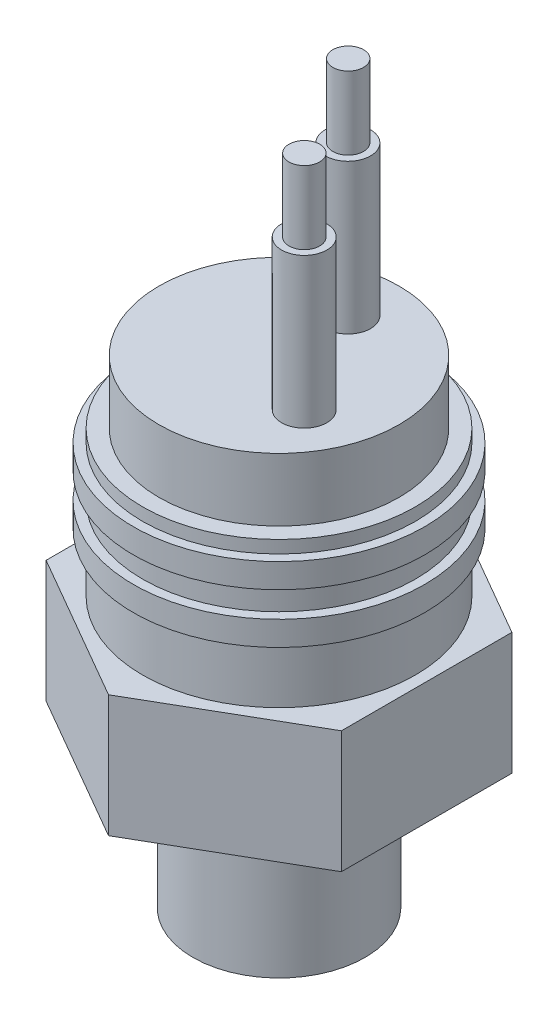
from build123d import *

# Parameters (mm, degrees)
EXTRUDE1_DEPTH    = 7.874
SKETCH3_R         = 7.747
EXTRUDE2_DEPTH    = 4.064
SKETCH4_R         = 1.4605
EXTRUDE3_DEPTH    = 9.652
SKETCH5_R         = 0.9906
EXTRUDE4_DEPTH    = 4.699
CIRPATTERN1_COUNT = 2
CIRPATTERN1_ANGLE = 120
SKETCH8_R         = 5.55625
EXTRUDE7_DEPTH    = 9.525
SKETCH9_R         = 0.89


with BuildPart() as part:
    # Sketch1 → Extrude1 (new body)
    with BuildSketch(Plane(origin=(0, 0, 0), x_dir=(1, 0, 0), z_dir=(0, 1, 0))):
        Polygon((0, 10.998522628), (-9.525, 5.499261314), (-9.525, -5.499261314), (0, -10.998522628), (9.525, -5.499261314), (9.525, 5.499261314), align=None)
    extrude(amount=EXTRUDE1_DEPTH)

    # Sketch2 → Revolve1 (revolve)
    with BuildSketch(Plane.XY, mode=Mode.PRIVATE) as revolve1_sk:
        Polygon((8.8011, 7.874), (8.8011, 11.6586), (9.398, 11.6586), (9.398, 13.2334), (8.8011, 13.2334), (8.8011, 14.8844), (9.398, 14.8844), (9.398, 16.4592), (8.8011, 16.4592), (8.8011, 17.272), (0, 17.272), (0, 7.874), align=None)
    revolve(revolve1_sk.sketch.rotate(Axis((0, 0, 0), (0, -1, 0)), 180), axis=Axis((0, 0, 0), (0, -1, 0)))

    # Sketch3 → Extrude2 (add)
    with BuildSketch(Plane(origin=(0, 17.272, 0), x_dir=(-1, 0, 0), z_dir=(0, 1, 0))):
        with Locations(Location((0, 0, 0), (0, 0, 180))):
            Circle(SKETCH3_R)
    extrude(amount=EXTRUDE2_DEPTH)

    # Sketch4 → Extrude3 (add)
    with BuildSketch(Plane(origin=(0, 21.336, 0), x_dir=(-1, 0, 0), z_dir=(0, 1, 0))):
        with Locations((0, -4.445)):
            Circle(SKETCH4_R)
    extrude3 = extrude(amount=EXTRUDE3_DEPTH)

    # Sketch5 → Extrude4 (add)
    with BuildSketch(Plane(origin=(0, 30.988, 0), x_dir=(-1, 0, 0), z_dir=(0, 1, 0))):
        with Locations((0, -4.463933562)):
            Circle(SKETCH5_R)
    extrude4 = extrude(amount=EXTRUDE4_DEPTH)

    # CirPattern1: Extrude3, Extrude4 ×2 about axis
    cirpattern1_axis = Axis((0, 0, 0), (0, -1, 0))
    add([extrude3.rotate(cirpattern1_axis, i * CIRPATTERN1_ANGLE / (CIRPATTERN1_COUNT - 1)) for i in range(1, CIRPATTERN1_COUNT)])
    add([extrude4.rotate(cirpattern1_axis, i * CIRPATTERN1_ANGLE / (CIRPATTERN1_COUNT - 1)) for i in range(1, CIRPATTERN1_COUNT)])

    # Sketch8 → Extrude7 (add)
    with BuildSketch(Plane.XZ):
        with Locations(Location((0, 0, 0), (0, 0, 90))):
            Circle(SKETCH8_R)
    extrude(amount=EXTRUDE7_DEPTH)

    # Sketch9 → o-ring 12.42x1.78 (revolve)
    with BuildSketch(Plane.XY, mode=Mode.PRIVATE) as o_ring_12_42x1_78_sk:
        with Locations((7.1, 0.284318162)):
            Circle(SKETCH9_R)
    revolve(o_ring_12_42x1_78_sk.sketch.rotate(Axis((0, 0, 0), (0, -1, 0)), 90), axis=Axis((0, 0, 0), (0, -1, 0)))


solid = part.part
